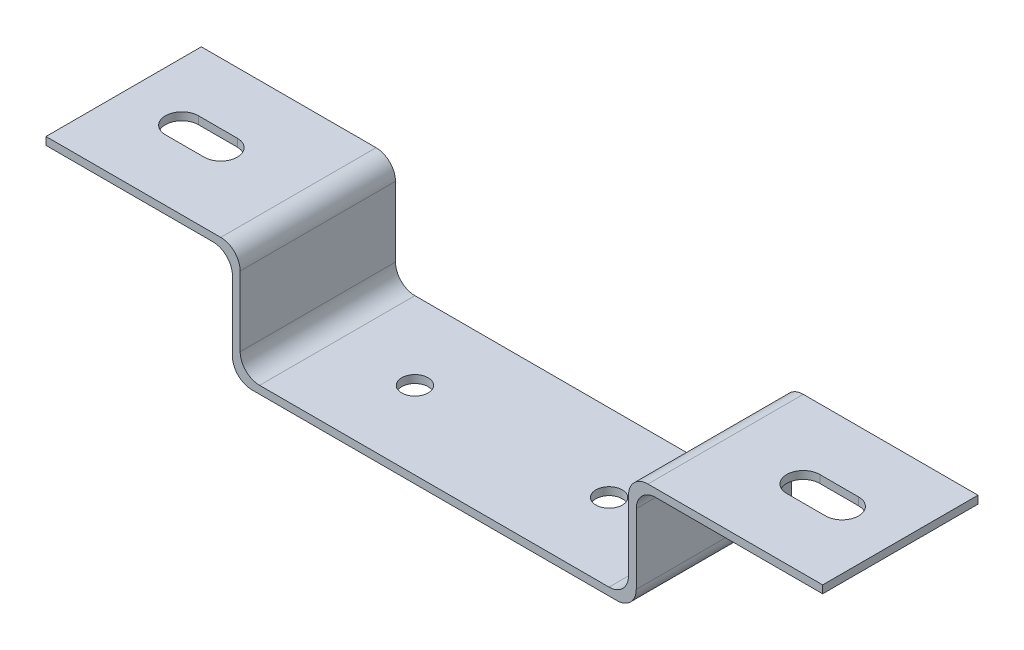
from build123d import *

# Parameters (mm, degrees)
EXTRUDE_1_DEPTH        = 40
CUT_EXTRUDE_1_REACH    = 207.874
HOLE_WIZARD_M8_1_D     = 6.8
HOLE_WIZARD_M8_1_DEPTH = 19.75
HOLE_WIZARD_M8_1_TIP   = 2.042926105


with BuildPart() as part:
    # Sketch 1 → Extrude 1 (new body)
    with BuildSketch(Plane.XY):
        with BuildLine():
            Line((0, 0), (45, 0))
            ThreePointArc((45, 0), (48.535533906, -1.464466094), (50, -5))
            Line((50, -5), (50, -23))
            ThreePointArc((50, -23), (51.464466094, -26.535533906), (55, -28))
            Line((55, -28), (145, -28))
            ThreePointArc((145, -28), (148.535533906, -26.535533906), (150, -23))
            Line((150, -23), (150, -5))
            ThreePointArc((150, -5), (151.464466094, -1.464466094), (155, 0))
            Line((155, 0), (200, 0))
            Line((200, 0), (200, -2))
            Line((200, -2), (157, -2))
            ThreePointArc((157, -2), (153.464466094, -3.464466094), (152, -7))
            Line((152, -7), (152, -25))
            ThreePointArc((152, -25), (150.535533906, -28.535533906), (147, -30))
            Line((147, -30), (53, -30))
            ThreePointArc((53, -30), (49.464466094, -28.535533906), (48, -25))
            Line((48, -25), (48, -7))
            ThreePointArc((48, -7), (46.535533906, -3.464466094), (43, -2))
            Line((43, -2), (0, -2))
            Line((0, -2), (0, 0))
        make_face()
    extrude(amount=EXTRUDE_1_DEPTH)

    # Sketch 2 → Cut-Extrude 1 (cut, up to next)
    with BuildSketch(Plane.XZ.offset(2), mode=Mode.PRIVATE) as cut_extrude_1_sk1:
        with BuildLine():
            Line((185, 15.75), (175, 15.75))
            ThreePointArc((175, 15.75), (170.75, 20), (175, 24.25))
            Line((175, 24.25), (185, 24.25))
            ThreePointArc((185, 24.25), (189.25, 20), (185, 15.75))
        make_face()
    cut_extrude_1_tool1 = extrude(cut_extrude_1_sk1.sketch, amount=-CUT_EXTRUDE_1_REACH, mode=Mode.PRIVATE) & part.part
    # Sketch 2 → Cut-Extrude 1 (cut, up to next)
    with BuildSketch(Plane.XZ.offset(2), mode=Mode.PRIVATE) as cut_extrude_1_sk2:
        with BuildLine():
            Line((25, 15.75), (15, 15.75))
            ThreePointArc((15, 15.75), (10.75, 20), (15, 24.25))
            Line((15, 24.25), (25, 24.25))
            ThreePointArc((25, 24.25), (29.25, 20), (25, 15.75))
        make_face()
    cut_extrude_1_tool2 = extrude(cut_extrude_1_sk2.sketch, amount=-CUT_EXTRUDE_1_REACH, mode=Mode.PRIVATE) & part.part
    add(cut_extrude_1_tool1.solids().sort_by_distance((180, -2, 20))[0], mode=Mode.SUBTRACT)
    add(cut_extrude_1_tool2.solids().sort_by_distance((20, -2, 20))[0], mode=Mode.SUBTRACT)

    # Hole Wizard M8 _1
    with Locations(Plane.XZ.offset(30)):
        with Locations((75, 20), (125, 20)):
            Hole(HOLE_WIZARD_M8_1_D / 2, depth=HOLE_WIZARD_M8_1_DEPTH)
            with Locations((0, 0, -(HOLE_WIZARD_M8_1_DEPTH + HOLE_WIZARD_M8_1_TIP / 2))):  # 118° drill point
                Cone(0, HOLE_WIZARD_M8_1_D / 2, HOLE_WIZARD_M8_1_TIP, mode=Mode.SUBTRACT)


solid = part.part
